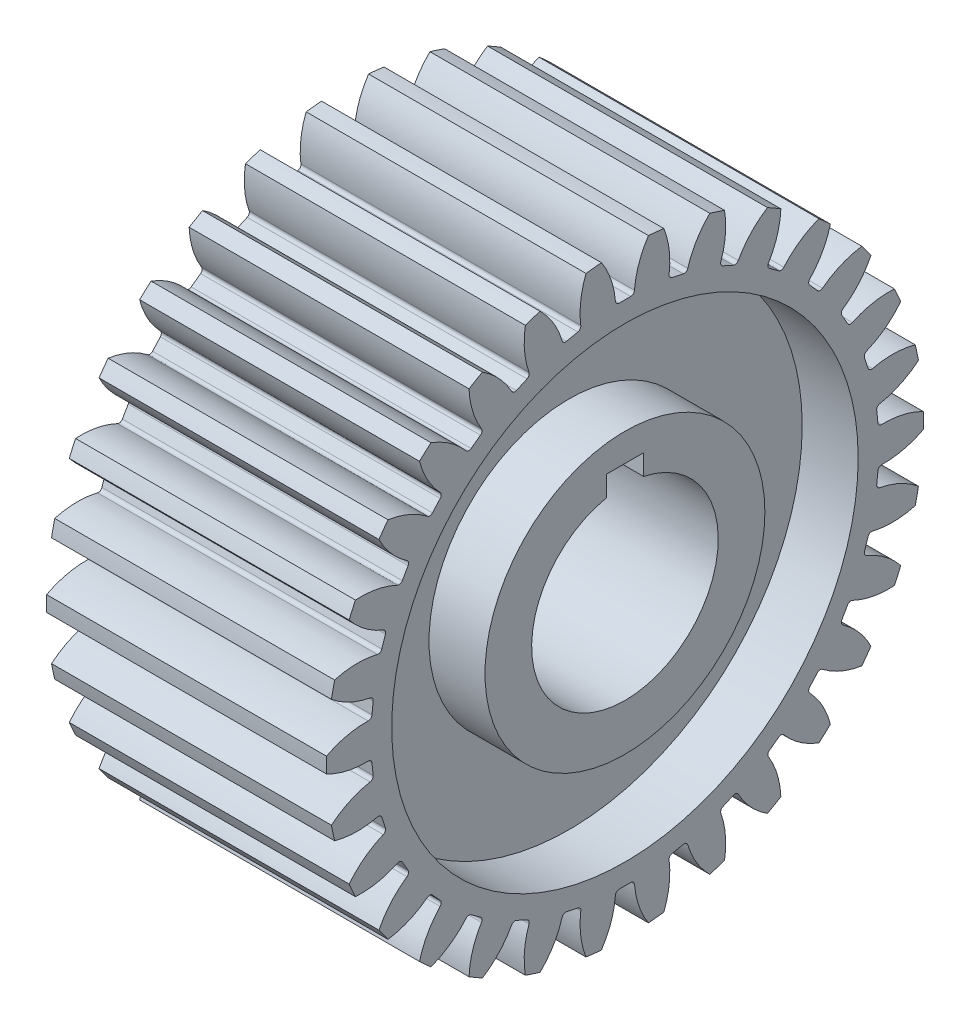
from build123d import *

# Parameters (mm, degrees)
SKETCH1_R                        = 16
CIRCULAR_EXTRUDE_DEPTH           = 7.5
CUT_CIRCULAR_TOP_RECTANGLE_DEPTH = 28.147743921
SKETCH4_R                        = 12.5
SKETCH4_R_2                      = 7.5
EXTRUDE_CUT_RAD_25_15_DEPTH      = 3
CUT_TOOTH_DEPTH                  = 28.147743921
F_30_NOS_COUNT                   = 30


with BuildPart() as part:
    # Sketch1 → circular - extrude (new, symmetric)
    with BuildSketch(Plane(origin=(0, 0, 0), x_dir=(0, 0, -1), z_dir=(1, 0, 0))):
        Circle(SKETCH1_R)
    extrude(amount=CIRCULAR_EXTRUDE_DEPTH, both=True)

    # Sketch3 → Cut- circular _ top rectangle (cut, through all)
    with BuildSketch(Plane(origin=(7.5, 0, 0), x_dir=(0, 0, -1), z_dir=(1, 0, 0))):
        with BuildLine():
            Line((-1, 4.898979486), (-1, 6))
            Line((-1, 6), (1, 6))
            Line((1, 6), (1, 4.898979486))
            ThreePointArc((1, 4.898979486), (0, -5), (-1, 4.898979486))
        make_face()
    extrude(amount=-CUT_CIRCULAR_TOP_RECTANGLE_DEPTH, mode=Mode.SUBTRACT)

    # Sketch4 → extrude cut _ rad_ 25 -15 (cut)
    with BuildSketch(Plane(origin=(7.5, 0, 0), x_dir=(0, 0, -1), z_dir=(1, 0, 0))):
        Circle(SKETCH4_R)
        Circle(SKETCH4_R_2, mode=Mode.SUBTRACT)
    extrude_cut_rad_25_15 = extrude(amount=-EXTRUDE_CUT_RAD_25_15_DEPTH, mode=Mode.SUBTRACT)

    # mirror - extrude cut: extrude cut _ rad_ 25 -15 across plane
    add(extrude_cut_rad_25_15.mirror(Plane(origin=(0, 0, 0), x_dir=(0, 0, 1), z_dir=(1, 0, 0))), mode=Mode.SUBTRACT)

    # Sketch5 → Cut - tooth (cut, through all)
    with BuildSketch(Plane(origin=(7.5, 0, 0), x_dir=(0, 0, -1), z_dir=(1, 0, 0))):
        with BuildLine():
            ThreePointArc((-0.510792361, 13.784267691), (-0.447157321, 13.653121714), (-0.311412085, 13.6))
            Line((-0.311412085, 13.6), (0.311412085, 13.6))
            ThreePointArc((0.311412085, 13.6), (0.447157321, 13.653121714), (0.510792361, 13.784267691))
            ThreePointArc((0.510792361, 13.784267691), (0.746805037, 14.91511034), (1.259418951, 15.950356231))
            ThreePointArc((1.259418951, 15.950356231), (0, 16), (-1.259418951, 15.950356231))
            ThreePointArc((-1.259418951, 15.950356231), (-0.746805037, 14.91511034), (-0.510792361, 13.784267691))
        make_face()
    cut_tooth = extrude(amount=-CUT_TOOTH_DEPTH, mode=Mode.SUBTRACT)

    # 30 nos: Cut - tooth ×30 about axis
    f_30_nos_axis = Axis((0, 0, 0), (1, 0, 0))
    for i in range(1, F_30_NOS_COUNT):
        add(cut_tooth.rotate(f_30_nos_axis, i * 360 / F_30_NOS_COUNT), mode=Mode.SUBTRACT)


solid = part.part
